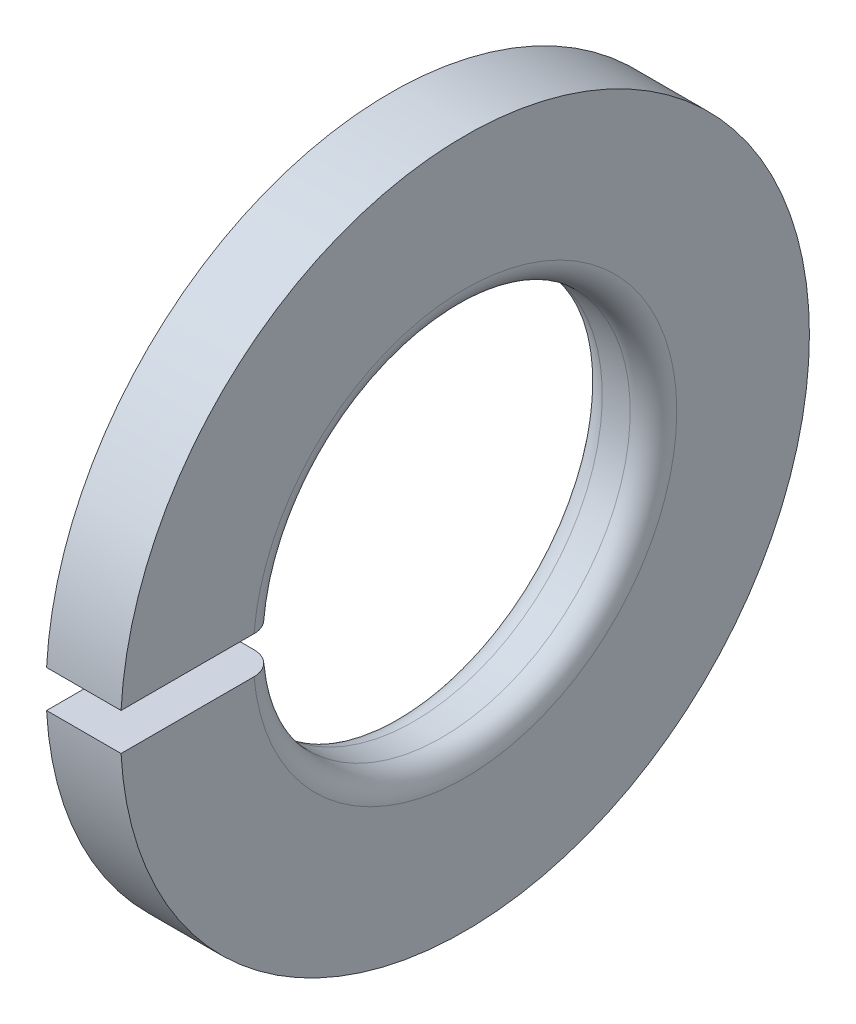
ISO-10303-21;
HEADER;
FILE_DESCRIPTION(('STEP AP214'),'2;1');
FILE_NAME('part.step','',(''),(''),'','','');
FILE_SCHEMA(('AUTOMOTIVE_DESIGN { 1 0 10303 214 1 1 1 1 }'));
ENDSEC;
DATA;
#1=APPLICATION_CONTEXT('core data for automotive mechanical design processes');
#2=APPLICATION_PROTOCOL_DEFINITION('international standard','automotive_design',2000,#1);
#3=PRODUCT_CONTEXT('',#1,'mechanical');
#4=PRODUCT('Part','Part','',(#3));
#5=PRODUCT_RELATED_PRODUCT_CATEGORY('part','',(#4));
#6=PRODUCT_DEFINITION_FORMATION('','',#4);
#7=PRODUCT_DEFINITION_CONTEXT('part definition',#1,'design');
#8=PRODUCT_DEFINITION('design','',#6,#7);
#9=PRODUCT_DEFINITION_SHAPE('','',#8);
#10=(LENGTH_UNIT() NAMED_UNIT(*) SI_UNIT(.MILLI.,.METRE.));
#11=(NAMED_UNIT(*) PLANE_ANGLE_UNIT() SI_UNIT($,.RADIAN.));
#12=(NAMED_UNIT(*) SI_UNIT($,.STERADIAN.) SOLID_ANGLE_UNIT());
#13=UNCERTAINTY_MEASURE_WITH_UNIT(LENGTH_MEASURE(1.E-05),#10,'distance_accuracy_value','');
#14=(GEOMETRIC_REPRESENTATION_CONTEXT(3) GLOBAL_UNCERTAINTY_ASSIGNED_CONTEXT((#13)) GLOBAL_UNIT_ASSIGNED_CONTEXT((#10,
#11,#12)) REPRESENTATION_CONTEXT('',''));
#15=CARTESIAN_POINT('',(0.,0.,0.));
#16=DIRECTION('',(0.,0.,1.));
#17=DIRECTION('',(1.,0.,0.));
#18=AXIS2_PLACEMENT_3D('',#15,#16,#17);
#19=CARTESIAN_POINT('',(-34.9249999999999,0.,0.));
#20=DIRECTION('',(-1.,0.,0.));
#21=DIRECTION('',(0.,0.,1.));
#22=AXIS2_PLACEMENT_3D('',#19,#20,#21);
#23=CYLINDRICAL_SURFACE('',#22,7.4);
#24=DIRECTION('',(-1.,0.,0.));
#25=VECTOR('',#24,1.);
#26=CARTESIAN_POINT('',(-34.9249999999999,0.4,7.38918128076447));
#27=LINE('',#26,#25);
#28=CARTESIAN_POINT('',(0.,0.4,7.38918128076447));
#29=VERTEX_POINT('',#28);
#30=CARTESIAN_POINT('',(-1.6,0.4,7.38918128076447));
#31=VERTEX_POINT('',#30);
#32=EDGE_CURVE('E46',#29,#31,#27,.T.);
#33=ORIENTED_EDGE('',*,*,#32,.F.);
#34=CARTESIAN_POINT('',(0.,0.,0.));
#35=DIRECTION('',(-1.,0.,0.));
#36=DIRECTION('',(0.,0.,1.));
#37=AXIS2_PLACEMENT_3D('',#34,#35,#36);
#38=CIRCLE('',#37,7.4);
#39=CARTESIAN_POINT('',(0.,-0.4,7.38918128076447));
#40=VERTEX_POINT('',#39);
#41=EDGE_CURVE('E107',#29,#40,#38,.T.);
#42=ORIENTED_EDGE('',*,*,#41,.T.);
#43=DIRECTION('',(-1.,0.,0.));
#44=VECTOR('',#43,1.);
#45=CARTESIAN_POINT('',(-34.9249999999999,-0.4,7.38918128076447));
#46=LINE('',#45,#44);
#47=CARTESIAN_POINT('',(-1.6,-0.4,7.38918128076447));
#48=VERTEX_POINT('',#47);
#49=EDGE_CURVE('E88',#48,#40,#46,.F.);
#50=ORIENTED_EDGE('',*,*,#49,.F.);
#51=CARTESIAN_POINT('',(-1.6,0.,0.));
#52=DIRECTION('',(-1.,0.,0.));
#53=DIRECTION('',(0.,0.,1.));
#54=AXIS2_PLACEMENT_3D('',#51,#52,#53);
#55=CIRCLE('',#54,7.4);
#56=EDGE_CURVE('E119',#31,#48,#55,.T.);
#57=ORIENTED_EDGE('',*,*,#56,.F.);
#58=EDGE_LOOP('',(#33,#42,#50,#57));
#59=FACE_BOUND('',#58,.T.);
#60=ADVANCED_FACE('F33',(#59),#23,.T.);
#61=CARTESIAN_POINT('',(0.,4.55,0.));
#62=DIRECTION('',(-1.,0.,0.));
#63=DIRECTION('',(0.,0.,1.));
#64=AXIS2_PLACEMENT_3D('',#61,#62,#63);
#65=PLANE('',#64);
#66=DIRECTION('',(0.,0.,-1.));
#67=VECTOR('',#66,1.);
#68=CARTESIAN_POINT('',(0.,0.4,7.548));
#69=LINE('',#68,#67);
#70=CARTESIAN_POINT('',(0.,0.4,4.53238347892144));
#71=VERTEX_POINT('',#70);
#72=EDGE_CURVE('E93',#29,#71,#69,.T.);
#73=ORIENTED_EDGE('',*,*,#72,.T.);
#74=CARTESIAN_POINT('',(0.,0.,0.));
#75=DIRECTION('',(-1.,0.,0.));
#76=DIRECTION('',(0.,0.,1.));
#77=AXIS2_PLACEMENT_3D('',#74,#75,#76);
#78=CIRCLE('',#77,4.55);
#79=CARTESIAN_POINT('',(0.,-0.4,4.53238347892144));
#80=VERTEX_POINT('',#79);
#81=EDGE_CURVE('E100',#71,#80,#78,.T.);
#82=ORIENTED_EDGE('',*,*,#81,.T.);
#83=DIRECTION('',(0.,0.,1.));
#84=VECTOR('',#83,1.);
#85=CARTESIAN_POINT('',(0.,-0.4,0.));
#86=LINE('',#85,#84);
#87=EDGE_CURVE('E82',#80,#40,#86,.T.);
#88=ORIENTED_EDGE('',*,*,#87,.T.);
#89=ORIENTED_EDGE('',*,*,#41,.F.);
#90=EDGE_LOOP('',(#73,#82,#88,#89));
#91=FACE_BOUND('',#90,.T.);
#92=ADVANCED_FACE('F106',(#91),#65,.F.);
#93=CARTESIAN_POINT('',(-0.5,0.,0.));
#94=DIRECTION('',(-1.,0.,0.));
#95=DIRECTION('',(0.,0.,1.));
#96=AXIS2_PLACEMENT_3D('',#93,#94,#95);
#97=TOROIDAL_SURFACE('',#96,4.55,0.500000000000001);
#98=ORIENTED_EDGE('',*,*,#81,.F.);
#99=CARTESIAN_POINT('',(-0.330409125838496,0.4,4.05998263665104));
#100=CARTESIAN_POINT('',(-0.356699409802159,0.4,4.05045896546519));
#101=CARTESIAN_POINT('',(-0.383811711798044,0.4,4.04314572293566));
#102=CARTESIAN_POINT('',(-0.43890146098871,0.4,4.0331697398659));
#103=CARTESIAN_POINT('',(-0.466879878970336,0.4,4.03051242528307));
#104=CARTESIAN_POINT('',(-0.522875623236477,0.4,4.02993732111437));
#105=CARTESIAN_POINT('',(-0.550892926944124,0.4,4.0320174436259));
#106=CARTESIAN_POINT('',(-0.606172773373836,0.4,4.04085230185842));
#107=CARTESIAN_POINT('',(-0.633435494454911,0.4,4.04760592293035));
#108=CARTESIAN_POINT('',(-0.686443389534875,0.4,4.06558912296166));
#109=CARTESIAN_POINT('',(-0.712188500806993,0.4,4.076818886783));
#110=CARTESIAN_POINT('',(-0.761436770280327,0.4,4.10342912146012));
#111=CARTESIAN_POINT('',(-0.784939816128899,0.4,4.11880980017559));
#112=CARTESIAN_POINT('',(-0.829113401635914,0.4,4.1533315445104));
#113=CARTESIAN_POINT('',(-0.849775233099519,0.4,4.17248375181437));
#114=CARTESIAN_POINT('',(-0.8876079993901,0.4,4.21397126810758));
#115=CARTESIAN_POINT('',(-0.90477885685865,0.4,4.23630664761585));
#116=CARTESIAN_POINT('',(-0.93522366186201,0.4,4.28363431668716));
#117=CARTESIAN_POINT('',(-0.948479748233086,0.4,4.30863809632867));
#118=CARTESIAN_POINT('',(-0.970623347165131,0.4,4.36051051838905));
#119=CARTESIAN_POINT('',(-0.979510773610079,0.4,4.38737919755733));
#120=CARTESIAN_POINT('',(-0.992694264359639,0.4,4.44232245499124));
#121=CARTESIAN_POINT('',(-0.996973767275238,0.4,4.4704010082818));
#122=CARTESIAN_POINT('',(-1.00076411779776,0.4,4.52687835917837));
#123=CARTESIAN_POINT('',(-1.0002749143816,0.4,4.55527716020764));
#124=CARTESIAN_POINT('',(-0.994535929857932,0.4,4.61162260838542));
#125=CARTESIAN_POINT('',(-0.989280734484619,0.4,4.63956870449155));
#126=CARTESIAN_POINT('',(-0.974146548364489,0.4,4.69417974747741));
#127=CARTESIAN_POINT('',(-0.964267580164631,0.4,4.72084470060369));
#128=CARTESIAN_POINT('',(-0.940178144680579,0.4,4.77209438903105));
#129=CARTESIAN_POINT('',(-0.925973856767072,0.4,4.79668202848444));
#130=CARTESIAN_POINT('',(-0.893627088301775,0.4,4.84311401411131));
#131=CARTESIAN_POINT('',(-0.875484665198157,0.4,4.8649584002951));
#132=CARTESIAN_POINT('',(-0.83583473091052,0.4,4.90521248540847));
#133=CARTESIAN_POINT('',(-0.814337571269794,0.4,4.92363238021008));
#134=CARTESIAN_POINT('',(-0.768547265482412,0.4,4.95658736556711));
#135=CARTESIAN_POINT('',(-0.744254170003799,0.4,4.97112252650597));
#136=CARTESIAN_POINT('',(-0.693647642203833,0.4,4.99584577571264));
#137=CARTESIAN_POINT('',(-0.667341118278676,0.4,5.00604800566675));
#138=CARTESIAN_POINT('',(-0.613386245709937,0.4,5.02187927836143));
#139=CARTESIAN_POINT('',(-0.585737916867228,0.4,5.0275083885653));
#140=CARTESIAN_POINT('',(-0.529954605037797,0.4,5.03402249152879));
#141=CARTESIAN_POINT('',(-0.501820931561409,0.4,5.03491870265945));
#142=CARTESIAN_POINT('',(-0.445803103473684,0.4,5.03197138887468));
#143=CARTESIAN_POINT('',(-0.417918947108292,0.4,5.0281278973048));
#144=CARTESIAN_POINT('',(-0.363212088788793,0.4,5.01581674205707));
#145=CARTESIAN_POINT('',(-0.336388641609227,0.4,5.00735238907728));
#146=CARTESIAN_POINT('',(-0.284541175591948,0.4,4.98604553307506));
#147=CARTESIAN_POINT('',(-0.259517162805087,0.4,4.97320301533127));
#148=CARTESIAN_POINT('',(-0.211946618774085,0.4,4.94349125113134));
#149=CARTESIAN_POINT('',(-0.189402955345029,0.4,4.92661741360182));
#150=CARTESIAN_POINT('',(-0.147459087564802,0.4,4.88933373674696));
#151=CARTESIAN_POINT('',(-0.128058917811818,0.4,4.86892385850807));
#152=CARTESIAN_POINT('',(-0.0928962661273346,0.4,4.82509033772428));
#153=CARTESIAN_POINT('',(-0.0771436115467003,0.4,4.8016588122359));
#154=CARTESIAN_POINT('',(-0.0497804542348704,0.4,4.75249065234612));
#155=CARTESIAN_POINT('',(-0.0381700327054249,0.4,4.72675397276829));
#156=CARTESIAN_POINT('',(-0.0193802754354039,0.4,4.67361422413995));
#157=CARTESIAN_POINT('',(-0.0122158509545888,0.4,4.64620588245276));
#158=CARTESIAN_POINT('',(-0.00257598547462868,0.4,4.59057656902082));
#159=CARTESIAN_POINT('',(-0.000100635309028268,0.4,4.5623555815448));
#160=CARTESIAN_POINT('',(9.48808271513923E-05,0.4,4.50581794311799));
#161=CARTESIAN_POINT('',(-0.00219827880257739,0.4,4.47750124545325));
#162=CARTESIAN_POINT('',(-0.0115011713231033,0.4,4.42165438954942));
#163=CARTESIAN_POINT('',(-0.0185107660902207,0.4,4.39412420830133));
#164=CARTESIAN_POINT('',(-0.0370577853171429,0.4,4.3406085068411));
#165=CARTESIAN_POINT('',(-0.04859888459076,0.4,4.31462426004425));
#166=CARTESIAN_POINT('',(-0.075890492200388,0.4,4.26495974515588));
#167=CARTESIAN_POINT('',(-0.091642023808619,0.4,4.2412800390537));
#168=CARTESIAN_POINT('',(-0.126885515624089,0.4,4.19694238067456));
#169=CARTESIAN_POINT('',(-0.146372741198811,0.4,4.17628066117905));
#170=CARTESIAN_POINT('',(-0.188537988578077,0.4,4.13855872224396));
#171=CARTESIAN_POINT('',(-0.211212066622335,0.4,4.12149411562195));
#172=CARTESIAN_POINT('',(-0.25014283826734,0.4,4.09706335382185));
#173=CARTESIAN_POINT('',(-0.265634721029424,0.4,4.08845497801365));
#174=CARTESIAN_POINT('',(-0.297444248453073,0.4,4.07292985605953));
#175=CARTESIAN_POINT('',(-0.313761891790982,0.4,4.06601310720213));
#176=CARTESIAN_POINT('',(-0.330409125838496,0.4,4.05998263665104));
#177=B_SPLINE_CURVE_WITH_KNOTS('',3,(#99,#100,#101,#102,#103,#104,#105,#106,#107,#108,#109,#110,
#111,#112,#113,#114,#115,#116,#117,#118,#119,#120,#121,#122,#123,#124,#125,#126,#127,#128,#129,
#130,#131,#132,#133,#134,#135,#136,#137,#138,#139,#140,#141,#142,#143,#144,#145,#146,#147,#148,
#149,#150,#151,#152,#153,#154,#155,#156,#157,#158,#159,#160,#161,#162,#163,#164,#165,#166,#167,
#168,#169,#170,#171,#172,#173,#174,#175,#176),.UNSPECIFIED.,.T.,.F.,(4,2,2,2,2,2,2,2,2,2,2,2,2,
2,2,2,2,2,2,2,2,2,2,2,2,2,2,2,2,2,2,2,2,2,2,2,2,2,4),(0.,0.0838218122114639,0.167741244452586,
0.251623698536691,0.335486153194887,0.41935207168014,0.503222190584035,0.587343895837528,
0.671467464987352,0.755969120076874,0.840472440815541,0.925278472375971,1.0100854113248,
1.09498881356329,1.17989180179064,1.26467405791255,1.34945507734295,1.43397948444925,
1.51850236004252,1.60274721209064,1.68699082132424,1.77103465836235,1.85507790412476,
1.93906101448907,2.02304440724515,2.10712390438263,2.19120432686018,2.27550871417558,
2.35981475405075,2.44440203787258,2.52899096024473,2.61381658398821,2.69863972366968,
2.78353179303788,2.8684445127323,2.95325031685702,3.03795208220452,3.0910288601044,
3.14410555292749),.UNSPECIFIED.);
#178=CARTESIAN_POINT('',(-0.5,0.4,4.03019850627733));
#179=VERTEX_POINT('',#178);
#180=EDGE_CURVE('E126',#71,#179,#177,.T.);
#181=ORIENTED_EDGE('',*,*,#180,.T.);
#182=CARTESIAN_POINT('',(-0.5,0.,0.));
#183=DIRECTION('',(-1.,0.,0.));
#184=DIRECTION('',(0.,0.,1.));
#185=AXIS2_PLACEMENT_3D('',#182,#183,#184);
#186=CIRCLE('',#185,4.05);
#187=CARTESIAN_POINT('',(-0.5,-0.4,4.03019850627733));
#188=VERTEX_POINT('',#187);
#189=EDGE_CURVE('E102',#179,#188,#186,.T.);
#190=ORIENTED_EDGE('',*,*,#189,.T.);
#191=CARTESIAN_POINT('',(-0.330409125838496,-0.4,4.05998263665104));
#192=CARTESIAN_POINT('',(-0.30399805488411,-0.4,4.06955274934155));
#193=CARTESIAN_POINT('',(-0.27837818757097,-0.4,4.08136780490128));
#194=CARTESIAN_POINT('',(-0.229468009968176,-0.4,4.10914708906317));
#195=CARTESIAN_POINT('',(-0.206180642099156,-0.4,4.12511646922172));
#196=CARTESIAN_POINT('',(-0.162628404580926,-0.4,4.16072554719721));
#197=CARTESIAN_POINT('',(-0.142361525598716,-0.4,4.18036278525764));
#198=CARTESIAN_POINT('',(-0.10540486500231,-0.4,4.22274546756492));
#199=CARTESIAN_POINT('',(-0.0887142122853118,-0.4,4.24549015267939));
#200=CARTESIAN_POINT('',(-0.0593145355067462,-0.4,4.29352811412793));
#201=CARTESIAN_POINT('',(-0.0466191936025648,-0.4,4.31882976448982));
#202=CARTESIAN_POINT('',(-0.0256391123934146,-0.4,4.37120120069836));
#203=CARTESIAN_POINT('',(-0.0173546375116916,-0.4,4.39827109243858));
#204=CARTESIAN_POINT('',(-0.00540643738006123,-0.4,4.45350983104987));
#205=CARTESIAN_POINT('',(-0.00175868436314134,-0.4,4.48168213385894));
#206=CARTESIAN_POINT('',(0.000760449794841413,-0.4,4.53823962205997));
#207=CARTESIAN_POINT('',(-0.000368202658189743,-0.4,4.56662480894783));
#208=CARTESIAN_POINT('',(-0.00737611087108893,-0.4,4.62283053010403));
#209=CARTESIAN_POINT('',(-0.0132599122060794,-0.4,4.6506504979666));
#210=CARTESIAN_POINT('',(-0.0296218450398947,-0.4,4.70490507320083));
#211=CARTESIAN_POINT('',(-0.0400999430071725,-0.4,4.73133969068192));
#212=CARTESIAN_POINT('',(-0.0653384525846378,-0.4,4.7820273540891));
#213=CARTESIAN_POINT('',(-0.0800921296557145,-0.4,4.80628375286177));
#214=CARTESIAN_POINT('',(-0.113474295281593,-0.4,4.85196527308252));
#215=CARTESIAN_POINT('',(-0.132102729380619,-0.4,4.87339043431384));
#216=CARTESIAN_POINT('',(-0.172644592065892,-0.4,4.91273005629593));
#217=CARTESIAN_POINT('',(-0.19454770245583,-0.4,4.93065515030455));
#218=CARTESIAN_POINT('',(-0.2410606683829,-0.4,4.96255932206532));
#219=CARTESIAN_POINT('',(-0.265670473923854,-0.4,4.97653847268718));
#220=CARTESIAN_POINT('',(-0.316811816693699,-0.4,5.00010680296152));
#221=CARTESIAN_POINT('',(-0.343336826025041,-0.4,5.00971014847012));
#222=CARTESIAN_POINT('',(-0.397624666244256,-0.4,5.02431588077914));
#223=CARTESIAN_POINT('',(-0.425387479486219,-0.4,5.0293183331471));
#224=CARTESIAN_POINT('',(-0.481295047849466,-0.4,5.03457129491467));
#225=CARTESIAN_POINT('',(-0.509438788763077,-0.4,5.03483260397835));
#226=CARTESIAN_POINT('',(-0.565370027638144,-0.4,5.03062343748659));
#227=CARTESIAN_POINT('',(-0.593157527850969,-0.4,5.02615299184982));
#228=CARTESIAN_POINT('',(-0.647570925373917,-0.4,5.01261353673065));
#229=CARTESIAN_POINT('',(-0.674197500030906,-0.4,5.00354724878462));
#230=CARTESIAN_POINT('',(-0.725553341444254,-0.4,4.98107859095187));
#231=CARTESIAN_POINT('',(-0.750282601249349,-0.4,4.96767620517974));
#232=CARTESIAN_POINT('',(-0.797176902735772,-0.4,4.93690019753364));
#233=CARTESIAN_POINT('',(-0.819338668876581,-0.4,4.91952158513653));
#234=CARTESIAN_POINT('',(-0.860439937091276,-0.4,4.88129967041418));
#235=CARTESIAN_POINT('',(-0.879379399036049,-0.4,4.86045632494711));
#236=CARTESIAN_POINT('',(-0.913555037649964,-0.4,4.81583644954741));
#237=CARTESIAN_POINT('',(-0.928780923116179,-0.4,4.79205203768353));
#238=CARTESIAN_POINT('',(-0.955038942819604,-0.4,4.74227124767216));
#239=CARTESIAN_POINT('',(-0.966071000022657,-0.4,4.71627482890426));
#240=CARTESIAN_POINT('',(-0.983666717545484,-0.4,4.66271495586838));
#241=CARTESIAN_POINT('',(-0.990215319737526,-0.4,4.63514655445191));
#242=CARTESIAN_POINT('',(-0.998605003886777,-0.4,4.57930250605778));
#243=CARTESIAN_POINT('',(-1.00044600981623,-0.4,4.55102684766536));
#244=CARTESIAN_POINT('',(-0.999370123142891,-0.4,4.49448976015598));
#245=CARTESIAN_POINT('',(-0.996440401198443,-0.4,4.46622857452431));
#246=CARTESIAN_POINT('',(-0.985881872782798,-0.4,4.41059778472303));
#247=CARTESIAN_POINT('',(-0.978253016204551,-0.4,4.38322819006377));
#248=CARTESIAN_POINT('',(-0.958501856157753,-0.4,4.33013753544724));
#249=CARTESIAN_POINT('',(-0.946376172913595,-0.4,4.30441773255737));
#250=CARTESIAN_POINT('',(-0.917971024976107,-0.4,4.25538396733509));
#251=CARTESIAN_POINT('',(-0.901691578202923,-0.4,4.23206999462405));
#252=CARTESIAN_POINT('',(-0.865470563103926,-0.4,4.18856023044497));
#253=CARTESIAN_POINT('',(-0.84553600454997,-0.4,4.16835860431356));
#254=CARTESIAN_POINT('',(-0.802546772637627,-0.4,4.13160624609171));
#255=CARTESIAN_POINT('',(-0.77949228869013,-0.4,4.11505529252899));
#256=CARTESIAN_POINT('',(-0.731019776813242,-0.4,4.08614782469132));
#257=CARTESIAN_POINT('',(-0.705612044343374,-0.4,4.07377404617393));
#258=CARTESIAN_POINT('',(-0.653066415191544,-0.4,4.05348603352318));
#259=CARTESIAN_POINT('',(-0.625928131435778,-0.4,4.04557280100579));
#260=CARTESIAN_POINT('',(-0.570813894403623,-0.4,4.0344647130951));
#261=CARTESIAN_POINT('',(-0.542841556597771,-0.4,4.03125186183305));
#262=CARTESIAN_POINT('',(-0.486779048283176,-0.4,4.02958609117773));
#263=CARTESIAN_POINT('',(-0.45868906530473,-0.4,4.03112731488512));
#264=CARTESIAN_POINT('',(-0.41381377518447,-0.4,4.03741323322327));
#265=CARTESIAN_POINT('',(-0.396812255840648,-0.4,4.04070793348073));
#266=CARTESIAN_POINT('',(-0.363243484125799,-0.4,4.04904542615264));
#267=CARTESIAN_POINT('',(-0.34667623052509,-0.4,4.05408821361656));
#268=CARTESIAN_POINT('',(-0.330409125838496,-0.4,4.05998263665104));
#269=B_SPLINE_CURVE_WITH_KNOTS('',3,(#191,#192,#193,#194,#195,#196,#197,#198,#199,#200,#201,
#202,#203,#204,#205,#206,#207,#208,#209,#210,#211,#212,#213,#214,#215,#216,#217,#218,#219,#220,
#221,#222,#223,#224,#225,#226,#227,#228,#229,#230,#231,#232,#233,#234,#235,#236,#237,#238,#239,
#240,#241,#242,#243,#244,#245,#246,#247,#248,#249,#250,#251,#252,#253,#254,#255,#256,#257,#258,
#259,#260,#261,#262,#263,#264,#265,#266,#267,#268),.UNSPECIFIED.,.T.,.F.,(4,2,2,2,2,2,2,2,2,2,2,
2,2,2,2,2,2,2,2,2,2,2,2,2,2,2,2,2,2,2,2,2,2,2,2,2,2,2,4),(0.,0.0842109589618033,
0.168526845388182,0.25278638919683,0.3370253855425,0.421549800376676,0.506079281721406,
0.590899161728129,0.675719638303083,0.7606212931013,0.845522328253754,0.930290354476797,
1.01505718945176,1.09956235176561,1.18406595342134,1.26829401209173,1.35252087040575,
1.43655584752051,1.52059029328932,1.60457503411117,1.68856008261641,1.77265112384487,
1.85674321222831,1.94106575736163,2.02538985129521,2.10999578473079,2.19460308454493,
2.2794382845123,2.36427438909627,2.44917438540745,2.53407401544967,2.61881249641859,
2.7035458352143,2.78792455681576,2.87232221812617,2.95639590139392,3.04036604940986,
3.09223340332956,3.14410061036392),.UNSPECIFIED.);
#270=EDGE_CURVE('E85',#188,#80,#269,.T.);
#271=ORIENTED_EDGE('',*,*,#270,.T.);
#272=EDGE_LOOP('',(#98,#181,#190,#271));
#273=FACE_BOUND('',#272,.T.);
#274=ADVANCED_FACE('F98',(#273),#97,.T.);
#275=CARTESIAN_POINT('',(-34.9249999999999,0.,0.));
#276=DIRECTION('',(-1.,0.,0.));
#277=DIRECTION('',(0.,0.,1.));
#278=AXIS2_PLACEMENT_3D('',#275,#276,#277);
#279=CYLINDRICAL_SURFACE('',#278,4.05);
#280=DIRECTION('',(-1.,0.,0.));
#281=VECTOR('',#280,1.);
#282=CARTESIAN_POINT('',(-34.9249999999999,0.4,4.03019850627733));
#283=LINE('',#282,#281);
#284=CARTESIAN_POINT('',(-1.1,0.4,4.03019850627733));
#285=VERTEX_POINT('',#284);
#286=EDGE_CURVE('E134',#285,#179,#283,.F.);
#287=ORIENTED_EDGE('',*,*,#286,.F.);
#288=CARTESIAN_POINT('',(-1.1,0.,0.));
#289=DIRECTION('',(-1.,0.,0.));
#290=DIRECTION('',(0.,0.,1.));
#291=AXIS2_PLACEMENT_3D('',#288,#289,#290);
#292=CIRCLE('',#291,4.05);
#293=CARTESIAN_POINT('',(-1.1,-0.4,4.03019850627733));
#294=VERTEX_POINT('',#293);
#295=EDGE_CURVE('E110',#285,#294,#292,.T.);
#296=ORIENTED_EDGE('',*,*,#295,.T.);
#297=DIRECTION('',(-1.,0.,0.));
#298=VECTOR('',#297,1.);
#299=CARTESIAN_POINT('',(-34.9249999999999,-0.4,4.03019850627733));
#300=LINE('',#299,#298);
#301=EDGE_CURVE('E103',#188,#294,#300,.T.);
#302=ORIENTED_EDGE('',*,*,#301,.F.);
#303=ORIENTED_EDGE('',*,*,#189,.F.);
#304=EDGE_LOOP('',(#287,#296,#302,#303));
#305=FACE_BOUND('',#304,.T.);
#306=ADVANCED_FACE('F133',(#305),#279,.F.);
#307=CARTESIAN_POINT('',(-1.1,0.,0.));
#308=DIRECTION('',(-1.,0.,0.));
#309=DIRECTION('',(0.,0.,1.));
#310=AXIS2_PLACEMENT_3D('',#307,#308,#309);
#311=TOROIDAL_SURFACE('',#310,4.55,0.500000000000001);
#312=ORIENTED_EDGE('',*,*,#295,.F.);
#313=CARTESIAN_POINT('',(-1.2695908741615,0.4,4.05998263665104));
#314=CARTESIAN_POINT('',(-1.29600194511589,0.4,4.06955274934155));
#315=CARTESIAN_POINT('',(-1.32162181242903,0.4,4.08136780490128));
#316=CARTESIAN_POINT('',(-1.37053199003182,0.4,4.10914708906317));
#317=CARTESIAN_POINT('',(-1.39381935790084,0.4,4.12511646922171));
#318=CARTESIAN_POINT('',(-1.43737159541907,0.4,4.16072554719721));
#319=CARTESIAN_POINT('',(-1.45763847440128,0.4,4.18036278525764));
#320=CARTESIAN_POINT('',(-1.49459513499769,0.4,4.22274546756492));
#321=CARTESIAN_POINT('',(-1.51128578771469,0.4,4.24549015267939));
#322=CARTESIAN_POINT('',(-1.54068546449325,0.4,4.29352811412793));
#323=CARTESIAN_POINT('',(-1.55338080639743,0.4,4.31882976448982));
#324=CARTESIAN_POINT('',(-1.57436088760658,0.4,4.37120120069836));
#325=CARTESIAN_POINT('',(-1.58264536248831,0.4,4.39827109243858));
#326=CARTESIAN_POINT('',(-1.59459356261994,0.4,4.45350983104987));
#327=CARTESIAN_POINT('',(-1.59824131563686,0.4,4.48168213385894));
#328=CARTESIAN_POINT('',(-1.60076044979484,0.4,4.53823962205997));
#329=CARTESIAN_POINT('',(-1.59963179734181,0.4,4.56662480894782));
#330=CARTESIAN_POINT('',(-1.59262388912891,0.4,4.62283053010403));
#331=CARTESIAN_POINT('',(-1.58674008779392,0.4,4.6506504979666));
#332=CARTESIAN_POINT('',(-1.57037815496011,0.4,4.70490507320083));
#333=CARTESIAN_POINT('',(-1.55990005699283,0.4,4.73133969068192));
#334=CARTESIAN_POINT('',(-1.53466154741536,0.4,4.7820273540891));
#335=CARTESIAN_POINT('',(-1.51990787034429,0.4,4.80628375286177));
#336=CARTESIAN_POINT('',(-1.48652570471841,0.4,4.85196527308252));
#337=CARTESIAN_POINT('',(-1.46789727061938,0.4,4.87339043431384));
#338=CARTESIAN_POINT('',(-1.42735540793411,0.4,4.91273005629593));
#339=CARTESIAN_POINT('',(-1.40545229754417,0.4,4.93065515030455));
#340=CARTESIAN_POINT('',(-1.3589393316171,0.4,4.96255932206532));
#341=CARTESIAN_POINT('',(-1.33432952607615,0.4,4.97653847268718));
#342=CARTESIAN_POINT('',(-1.2831881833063,0.4,5.00010680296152));
#343=CARTESIAN_POINT('',(-1.25666317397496,0.4,5.00971014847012));
#344=CARTESIAN_POINT('',(-1.20237533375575,0.4,5.02431588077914));
#345=CARTESIAN_POINT('',(-1.17461252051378,0.4,5.0293183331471));
#346=CARTESIAN_POINT('',(-1.11870495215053,0.4,5.03457129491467));
#347=CARTESIAN_POINT('',(-1.09056121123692,0.4,5.03483260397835));
#348=CARTESIAN_POINT('',(-1.03462997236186,0.4,5.03062343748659));
#349=CARTESIAN_POINT('',(-1.00684247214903,0.4,5.02615299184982));
#350=CARTESIAN_POINT('',(-0.952429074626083,0.4,5.01261353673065));
#351=CARTESIAN_POINT('',(-0.925802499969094,0.4,5.00354724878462));
#352=CARTESIAN_POINT('',(-0.874446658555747,0.4,4.98107859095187));
#353=CARTESIAN_POINT('',(-0.849717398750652,0.4,4.96767620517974));
#354=CARTESIAN_POINT('',(-0.802823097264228,0.4,4.93690019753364));
#355=CARTESIAN_POINT('',(-0.780661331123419,0.4,4.91952158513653));
#356=CARTESIAN_POINT('',(-0.739560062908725,0.4,4.88129967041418));
#357=CARTESIAN_POINT('',(-0.720620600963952,0.4,4.86045632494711));
#358=CARTESIAN_POINT('',(-0.686444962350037,0.4,4.81583644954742));
#359=CARTESIAN_POINT('',(-0.671219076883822,0.4,4.79205203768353));
#360=CARTESIAN_POINT('',(-0.644961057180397,0.4,4.74227124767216));
#361=CARTESIAN_POINT('',(-0.633928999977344,0.4,4.71627482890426));
#362=CARTESIAN_POINT('',(-0.616333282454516,0.4,4.66271495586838));
#363=CARTESIAN_POINT('',(-0.609784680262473,0.4,4.63514655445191));
#364=CARTESIAN_POINT('',(-0.601394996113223,0.4,4.57930250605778));
#365=CARTESIAN_POINT('',(-0.59955399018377,0.4,4.55102684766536));
#366=CARTESIAN_POINT('',(-0.600629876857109,0.4,4.49448976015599));
#367=CARTESIAN_POINT('',(-0.603559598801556,0.4,4.46622857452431));
#368=CARTESIAN_POINT('',(-0.614118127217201,0.4,4.41059778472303));
#369=CARTESIAN_POINT('',(-0.621746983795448,0.4,4.38322819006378));
#370=CARTESIAN_POINT('',(-0.641498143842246,0.4,4.33013753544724));
#371=CARTESIAN_POINT('',(-0.653623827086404,0.4,4.30441773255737));
#372=CARTESIAN_POINT('',(-0.682028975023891,0.4,4.25538396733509));
#373=CARTESIAN_POINT('',(-0.698308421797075,0.4,4.23206999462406));
#374=CARTESIAN_POINT('',(-0.734529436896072,0.4,4.18856023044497));
#375=CARTESIAN_POINT('',(-0.754463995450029,0.4,4.16835860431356));
#376=CARTESIAN_POINT('',(-0.797453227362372,0.4,4.13160624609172));
#377=CARTESIAN_POINT('',(-0.820507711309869,0.4,4.11505529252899));
#378=CARTESIAN_POINT('',(-0.868980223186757,0.4,4.08614782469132));
#379=CARTESIAN_POINT('',(-0.894387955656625,0.4,4.07377404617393));
#380=CARTESIAN_POINT('',(-0.946933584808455,0.4,4.05348603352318));
#381=CARTESIAN_POINT('',(-0.974071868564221,0.4,4.04557280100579));
#382=CARTESIAN_POINT('',(-1.02918610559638,0.4,4.0344647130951));
#383=CARTESIAN_POINT('',(-1.05715844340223,0.4,4.03125186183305));
#384=CARTESIAN_POINT('',(-1.11322095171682,0.4,4.02958609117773));
#385=CARTESIAN_POINT('',(-1.14131093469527,0.4,4.03112731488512));
#386=CARTESIAN_POINT('',(-1.18618622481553,0.4,4.03741323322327));
#387=CARTESIAN_POINT('',(-1.20318774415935,0.4,4.04070793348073));
#388=CARTESIAN_POINT('',(-1.2367565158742,0.4,4.04904542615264));
#389=CARTESIAN_POINT('',(-1.25332376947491,0.4,4.05408821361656));
#390=CARTESIAN_POINT('',(-1.2695908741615,0.4,4.05998263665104));
#391=B_SPLINE_CURVE_WITH_KNOTS('',3,(#313,#314,#315,#316,#317,#318,#319,#320,#321,#322,#323,
#324,#325,#326,#327,#328,#329,#330,#331,#332,#333,#334,#335,#336,#337,#338,#339,#340,#341,#342,
#343,#344,#345,#346,#347,#348,#349,#350,#351,#352,#353,#354,#355,#356,#357,#358,#359,#360,#361,
#362,#363,#364,#365,#366,#367,#368,#369,#370,#371,#372,#373,#374,#375,#376,#377,#378,#379,#380,
#381,#382,#383,#384,#385,#386,#387,#388,#389,#390),.UNSPECIFIED.,.T.,.F.,(4,2,2,2,2,2,2,2,2,2,2,
2,2,2,2,2,2,2,2,2,2,2,2,2,2,2,2,2,2,2,2,2,2,2,2,2,2,2,4),(0.,0.084210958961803,
0.168526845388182,0.252786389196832,0.337025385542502,0.421549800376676,0.506079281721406,
0.590899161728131,0.675719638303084,0.760621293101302,0.845522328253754,0.930290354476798,
1.01505718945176,1.09956235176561,1.18406595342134,1.26829401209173,1.35252087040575,
1.43655584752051,1.52059029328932,1.60457503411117,1.68856008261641,1.77265112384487,
1.85674321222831,1.94106575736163,2.02538985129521,2.10999578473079,2.19460308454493,
2.2794382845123,2.36427438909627,2.44917438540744,2.53407401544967,2.61881249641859,
2.7035458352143,2.78792455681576,2.87232221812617,2.95639590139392,3.04036604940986,
3.09223340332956,3.14410061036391),.UNSPECIFIED.);
#392=CARTESIAN_POINT('',(-1.6,0.4,4.53238347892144));
#393=VERTEX_POINT('',#392);
#394=EDGE_CURVE('E120',#285,#393,#391,.T.);
#395=ORIENTED_EDGE('',*,*,#394,.T.);
#396=CARTESIAN_POINT('',(-1.6,0.,0.));
#397=DIRECTION('',(-1.,0.,0.));
#398=DIRECTION('',(0.,0.,1.));
#399=AXIS2_PLACEMENT_3D('',#396,#397,#398);
#400=CIRCLE('',#399,4.55);
#401=CARTESIAN_POINT('',(-1.6,-0.4,4.53238347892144));
#402=VERTEX_POINT('',#401);
#403=EDGE_CURVE('E123',#393,#402,#400,.T.);
#404=ORIENTED_EDGE('',*,*,#403,.T.);
#405=CARTESIAN_POINT('',(-1.2695908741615,-0.4,4.05998263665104));
#406=CARTESIAN_POINT('',(-1.24330059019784,-0.4,4.05045896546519));
#407=CARTESIAN_POINT('',(-1.21618828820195,-0.4,4.04314572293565));
#408=CARTESIAN_POINT('',(-1.16109853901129,-0.4,4.0331697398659));
#409=CARTESIAN_POINT('',(-1.13312012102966,-0.4,4.03051242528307));
#410=CARTESIAN_POINT('',(-1.07712437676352,-0.4,4.02993732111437));
#411=CARTESIAN_POINT('',(-1.04910707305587,-0.4,4.0320174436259));
#412=CARTESIAN_POINT('',(-0.993827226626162,-0.4,4.04085230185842));
#413=CARTESIAN_POINT('',(-0.966564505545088,-0.4,4.04760592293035));
#414=CARTESIAN_POINT('',(-0.913556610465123,-0.4,4.06558912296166));
#415=CARTESIAN_POINT('',(-0.887811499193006,-0.4,4.07681888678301));
#416=CARTESIAN_POINT('',(-0.838563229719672,-0.4,4.10342912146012));
#417=CARTESIAN_POINT('',(-0.8150601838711,-0.4,4.11880980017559));
#418=CARTESIAN_POINT('',(-0.770886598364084,-0.4,4.1533315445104));
#419=CARTESIAN_POINT('',(-0.750224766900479,-0.4,4.17248375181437));
#420=CARTESIAN_POINT('',(-0.712392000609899,-0.4,4.21397126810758));
#421=CARTESIAN_POINT('',(-0.69522114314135,-0.4,4.23630664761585));
#422=CARTESIAN_POINT('',(-0.664776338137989,-0.4,4.28363431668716));
#423=CARTESIAN_POINT('',(-0.651520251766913,-0.4,4.30863809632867));
#424=CARTESIAN_POINT('',(-0.629376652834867,-0.4,4.36051051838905));
#425=CARTESIAN_POINT('',(-0.62048922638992,-0.4,4.38737919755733));
#426=CARTESIAN_POINT('',(-0.60730573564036,-0.4,4.44232245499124));
#427=CARTESIAN_POINT('',(-0.603026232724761,-0.4,4.4704010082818));
#428=CARTESIAN_POINT('',(-0.599235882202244,-0.4,4.52687835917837));
#429=CARTESIAN_POINT('',(-0.599725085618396,-0.4,4.55527716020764));
#430=CARTESIAN_POINT('',(-0.605464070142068,-0.4,4.61162260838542));
#431=CARTESIAN_POINT('',(-0.610719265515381,-0.4,4.63956870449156));
#432=CARTESIAN_POINT('',(-0.625853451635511,-0.4,4.69417974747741));
#433=CARTESIAN_POINT('',(-0.635732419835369,-0.4,4.72084470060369));
#434=CARTESIAN_POINT('',(-0.659821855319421,-0.4,4.77209438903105));
#435=CARTESIAN_POINT('',(-0.674026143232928,-0.4,4.79668202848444));
#436=CARTESIAN_POINT('',(-0.706372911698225,-0.4,4.84311401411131));
#437=CARTESIAN_POINT('',(-0.724515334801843,-0.4,4.8649584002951));
#438=CARTESIAN_POINT('',(-0.764165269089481,-0.4,4.90521248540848));
#439=CARTESIAN_POINT('',(-0.785662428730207,-0.4,4.92363238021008));
#440=CARTESIAN_POINT('',(-0.831452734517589,-0.4,4.95658736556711));
#441=CARTESIAN_POINT('',(-0.855745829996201,-0.4,4.97112252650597));
#442=CARTESIAN_POINT('',(-0.906352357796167,-0.4,4.99584577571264));
#443=CARTESIAN_POINT('',(-0.932658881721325,-0.4,5.00604800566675));
#444=CARTESIAN_POINT('',(-0.986613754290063,-0.4,5.02187927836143));
#445=CARTESIAN_POINT('',(-1.01426208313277,-0.4,5.0275083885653));
#446=CARTESIAN_POINT('',(-1.0700453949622,-0.4,5.03402249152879));
#447=CARTESIAN_POINT('',(-1.09817906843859,-0.4,5.03491870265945));
#448=CARTESIAN_POINT('',(-1.15419689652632,-0.4,5.03197138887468));
#449=CARTESIAN_POINT('',(-1.18208105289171,-0.4,5.0281278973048));
#450=CARTESIAN_POINT('',(-1.23678791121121,-0.4,5.01581674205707));
#451=CARTESIAN_POINT('',(-1.26361135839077,-0.4,5.00735238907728));
#452=CARTESIAN_POINT('',(-1.31545882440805,-0.4,4.98604553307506));
#453=CARTESIAN_POINT('',(-1.34048283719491,-0.4,4.97320301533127));
#454=CARTESIAN_POINT('',(-1.38805338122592,-0.4,4.94349125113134));
#455=CARTESIAN_POINT('',(-1.41059704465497,-0.4,4.92661741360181));
#456=CARTESIAN_POINT('',(-1.4525409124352,-0.4,4.88933373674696));
#457=CARTESIAN_POINT('',(-1.47194108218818,-0.4,4.86892385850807));
#458=CARTESIAN_POINT('',(-1.50710373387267,-0.4,4.82509033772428));
#459=CARTESIAN_POINT('',(-1.5228563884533,-0.4,4.8016588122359));
#460=CARTESIAN_POINT('',(-1.55021954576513,-0.4,4.75249065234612));
#461=CARTESIAN_POINT('',(-1.56182996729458,-0.4,4.72675397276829));
#462=CARTESIAN_POINT('',(-1.5806197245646,-0.4,4.67361422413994));
#463=CARTESIAN_POINT('',(-1.58778414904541,-0.4,4.64620588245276));
#464=CARTESIAN_POINT('',(-1.59742401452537,-0.4,4.59057656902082));
#465=CARTESIAN_POINT('',(-1.59989936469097,-0.4,4.56235558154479));
#466=CARTESIAN_POINT('',(-1.60009488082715,-0.4,4.50581794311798));
#467=CARTESIAN_POINT('',(-1.59780172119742,-0.4,4.47750124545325));
#468=CARTESIAN_POINT('',(-1.5884988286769,-0.4,4.42165438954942));
#469=CARTESIAN_POINT('',(-1.58148923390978,-0.4,4.39412420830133));
#470=CARTESIAN_POINT('',(-1.56294221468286,-0.4,4.3406085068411));
#471=CARTESIAN_POINT('',(-1.55140111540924,-0.4,4.31462426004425));
#472=CARTESIAN_POINT('',(-1.52410950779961,-0.4,4.26495974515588));
#473=CARTESIAN_POINT('',(-1.50835797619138,-0.4,4.24128003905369));
#474=CARTESIAN_POINT('',(-1.47311448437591,-0.4,4.19694238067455));
#475=CARTESIAN_POINT('',(-1.45362725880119,-0.4,4.17628066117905));
#476=CARTESIAN_POINT('',(-1.41146201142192,-0.4,4.13855872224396));
#477=CARTESIAN_POINT('',(-1.38878793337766,-0.4,4.12149411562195));
#478=CARTESIAN_POINT('',(-1.34985716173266,-0.4,4.09706335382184));
#479=CARTESIAN_POINT('',(-1.33436527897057,-0.4,4.08845497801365));
#480=CARTESIAN_POINT('',(-1.30255575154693,-0.4,4.07292985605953));
#481=CARTESIAN_POINT('',(-1.28623810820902,-0.4,4.06601310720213));
#482=CARTESIAN_POINT('',(-1.2695908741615,-0.4,4.05998263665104));
#483=B_SPLINE_CURVE_WITH_KNOTS('',3,(#405,#406,#407,#408,#409,#410,#411,#412,#413,#414,#415,
#416,#417,#418,#419,#420,#421,#422,#423,#424,#425,#426,#427,#428,#429,#430,#431,#432,#433,#434,
#435,#436,#437,#438,#439,#440,#441,#442,#443,#444,#445,#446,#447,#448,#449,#450,#451,#452,#453,
#454,#455,#456,#457,#458,#459,#460,#461,#462,#463,#464,#465,#466,#467,#468,#469,#470,#471,#472,
#473,#474,#475,#476,#477,#478,#479,#480,#481,#482),.UNSPECIFIED.,.T.,.F.,(4,2,2,2,2,2,2,2,2,2,2,
2,2,2,2,2,2,2,2,2,2,2,2,2,2,2,2,2,2,2,2,2,2,2,2,2,2,2,4),(0.,0.0838218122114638,
0.167741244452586,0.251623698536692,0.335486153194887,0.41935207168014,0.503222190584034,
0.587343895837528,0.671467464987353,0.755969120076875,0.840472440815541,0.92527847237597,
1.0100854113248,1.09498881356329,1.17989180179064,1.26467405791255,1.34945507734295,
1.43397948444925,1.51850236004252,1.60274721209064,1.68699082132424,1.77103465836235,
1.85507790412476,1.93906101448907,2.02304440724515,2.10712390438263,2.19120432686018,
2.27550871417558,2.35981475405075,2.44440203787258,2.52899096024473,2.61381658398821,
2.69863972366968,2.78353179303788,2.8684445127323,2.95325031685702,3.03795208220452,
3.0910288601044,3.14410555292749),.UNSPECIFIED.);
#484=EDGE_CURVE('E54',#402,#294,#483,.T.);
#485=ORIENTED_EDGE('',*,*,#484,.T.);
#486=EDGE_LOOP('',(#312,#395,#404,#485));
#487=FACE_BOUND('',#486,.T.);
#488=ADVANCED_FACE('F137',(#487),#311,.T.);
#489=CARTESIAN_POINT('',(-1.6,7.4,0.));
#490=DIRECTION('',(1.,0.,0.));
#491=DIRECTION('',(0.,0.,-1.));
#492=AXIS2_PLACEMENT_3D('',#489,#490,#491);
#493=PLANE('',#492);
#494=DIRECTION('',(0.,0.,-1.));
#495=VECTOR('',#494,1.);
#496=CARTESIAN_POINT('',(-1.6,0.4,0.));
#497=LINE('',#496,#495);
#498=EDGE_CURVE('E11',#31,#393,#497,.T.);
#499=ORIENTED_EDGE('',*,*,#498,.F.);
#500=ORIENTED_EDGE('',*,*,#56,.T.);
#501=DIRECTION('',(0.,0.,1.));
#502=VECTOR('',#501,1.);
#503=CARTESIAN_POINT('',(-1.6,-0.4,0.));
#504=LINE('',#503,#502);
#505=EDGE_CURVE('E40',#402,#48,#504,.T.);
#506=ORIENTED_EDGE('',*,*,#505,.F.);
#507=ORIENTED_EDGE('',*,*,#403,.F.);
#508=EDGE_LOOP('',(#499,#500,#506,#507));
#509=FACE_BOUND('',#508,.T.);
#510=ADVANCED_FACE('F122',(#509),#493,.F.);
#511=CARTESIAN_POINT('',(-1.6,-0.4,0.));
#512=DIRECTION('',(0.,1.,0.));
#513=DIRECTION('',(0.,0.,1.));
#514=AXIS2_PLACEMENT_3D('',#511,#512,#513);
#515=PLANE('',#514);
#516=ORIENTED_EDGE('',*,*,#49,.T.);
#517=ORIENTED_EDGE('',*,*,#87,.F.);
#518=ORIENTED_EDGE('',*,*,#270,.F.);
#519=ORIENTED_EDGE('',*,*,#301,.T.);
#520=ORIENTED_EDGE('',*,*,#484,.F.);
#521=ORIENTED_EDGE('',*,*,#505,.T.);
#522=EDGE_LOOP('',(#516,#517,#518,#519,#520,#521));
#523=FACE_BOUND('',#522,.T.);
#524=ADVANCED_FACE('F84',(#523),#515,.T.);
#525=CARTESIAN_POINT('',(-1.6,0.4,7.548));
#526=DIRECTION('',(0.,-1.,0.));
#527=DIRECTION('',(0.,0.,-1.));
#528=AXIS2_PLACEMENT_3D('',#525,#526,#527);
#529=PLANE('',#528);
#530=ORIENTED_EDGE('',*,*,#32,.T.);
#531=ORIENTED_EDGE('',*,*,#498,.T.);
#532=ORIENTED_EDGE('',*,*,#394,.F.);
#533=ORIENTED_EDGE('',*,*,#286,.T.);
#534=ORIENTED_EDGE('',*,*,#180,.F.);
#535=ORIENTED_EDGE('',*,*,#72,.F.);
#536=EDGE_LOOP('',(#530,#531,#532,#533,#534,#535));
#537=FACE_BOUND('',#536,.T.);
#538=ADVANCED_FACE('F152',(#537),#529,.T.);
#539=CLOSED_SHELL('',(#60,#92,#274,#306,#488,#510,#524,#538));
#540=MANIFOLD_SOLID_BREP('B2',#539);
#541=ADVANCED_BREP_SHAPE_REPRESENTATION('',(#18,#540),#14);
#542=SHAPE_DEFINITION_REPRESENTATION(#9,#541);
ENDSEC;
END-ISO-10303-21;
